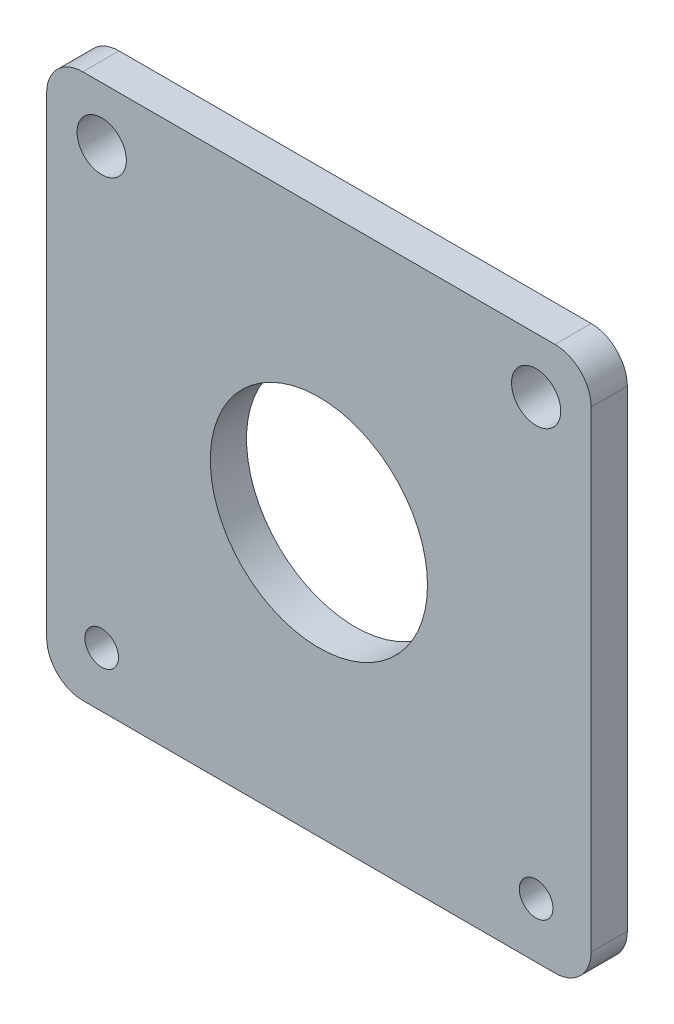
ISO-10303-21;
HEADER;
FILE_DESCRIPTION(('STEP AP214'),'2;1');
FILE_NAME('part.step','',(''),(''),'','','');
FILE_SCHEMA(('AUTOMOTIVE_DESIGN { 1 0 10303 214 1 1 1 1 }'));
ENDSEC;
DATA;
#1=APPLICATION_CONTEXT('core data for automotive mechanical design processes');
#2=APPLICATION_PROTOCOL_DEFINITION('international standard','automotive_design',2000,#1);
#3=PRODUCT_CONTEXT('',#1,'mechanical');
#4=PRODUCT('Part','Part','',(#3));
#5=PRODUCT_RELATED_PRODUCT_CATEGORY('part','',(#4));
#6=PRODUCT_DEFINITION_FORMATION('','',#4);
#7=PRODUCT_DEFINITION_CONTEXT('part definition',#1,'design');
#8=PRODUCT_DEFINITION('design','',#6,#7);
#9=PRODUCT_DEFINITION_SHAPE('','',#8);
#10=(LENGTH_UNIT() NAMED_UNIT(*) SI_UNIT(.MILLI.,.METRE.));
#11=(NAMED_UNIT(*) PLANE_ANGLE_UNIT() SI_UNIT($,.RADIAN.));
#12=(NAMED_UNIT(*) SI_UNIT($,.STERADIAN.) SOLID_ANGLE_UNIT());
#13=UNCERTAINTY_MEASURE_WITH_UNIT(LENGTH_MEASURE(1.E-05),#10,'distance_accuracy_value','');
#14=(GEOMETRIC_REPRESENTATION_CONTEXT(3) GLOBAL_UNCERTAINTY_ASSIGNED_CONTEXT((#13)) GLOBAL_UNIT_ASSIGNED_CONTEXT((#10,
#11,#12)) REPRESENTATION_CONTEXT('',''));
#15=CARTESIAN_POINT('',(0.,0.,0.));
#16=DIRECTION('',(0.,0.,1.));
#17=DIRECTION('',(1.,0.,0.));
#18=AXIS2_PLACEMENT_3D('',#15,#16,#17);
#19=CARTESIAN_POINT('',(23.876,-23.876,3.175));
#20=DIRECTION('',(0.,0.,1.));
#21=DIRECTION('',(1.,0.,0.));
#22=AXIS2_PLACEMENT_3D('',#19,#20,#21);
#23=PLANE('',#22);
#24=CARTESIAN_POINT('',(19.05,-19.05,3.175));
#25=DIRECTION('',(0.,0.,1.));
#26=DIRECTION('',(1.,0.,0.));
#27=AXIS2_PLACEMENT_3D('',#24,#25,#26);
#28=CIRCLE('',#27,1.4732);
#29=CARTESIAN_POINT('',(20.5232,-19.05,3.175));
#30=VERTEX_POINT('',#29);
#31=EDGE_CURVE('E333',#30,#30,#28,.T.);
#32=ORIENTED_EDGE('',*,*,#31,.F.);
#33=EDGE_LOOP('',(#32));
#34=FACE_BOUND('',#33,.T.);
#35=CARTESIAN_POINT('',(19.05,19.05,3.175));
#36=DIRECTION('',(0.,0.,1.));
#37=DIRECTION('',(1.,0.,0.));
#38=AXIS2_PLACEMENT_3D('',#35,#36,#37);
#39=CIRCLE('',#38,2.159);
#40=CARTESIAN_POINT('',(21.209,19.05,3.175));
#41=VERTEX_POINT('',#40);
#42=EDGE_CURVE('E319',#41,#41,#39,.T.);
#43=ORIENTED_EDGE('',*,*,#42,.F.);
#44=EDGE_LOOP('',(#43));
#45=FACE_BOUND('',#44,.T.);
#46=DIRECTION('',(0.,1.,0.));
#47=VECTOR('',#46,1.);
#48=CARTESIAN_POINT('',(23.876,23.876,3.175));
#49=LINE('',#48,#47);
#50=CARTESIAN_POINT('',(23.876,-20.701,3.175));
#51=VERTEX_POINT('',#50);
#52=CARTESIAN_POINT('',(23.876,20.701,3.175));
#53=VERTEX_POINT('',#52);
#54=EDGE_CURVE('E134',#51,#53,#49,.T.);
#55=ORIENTED_EDGE('',*,*,#54,.T.);
#56=CARTESIAN_POINT('',(20.701,20.701,3.175));
#57=DIRECTION('',(0.,0.,1.));
#58=DIRECTION('',(1.,0.,0.));
#59=AXIS2_PLACEMENT_3D('',#56,#57,#58);
#60=CIRCLE('',#59,3.175);
#61=CARTESIAN_POINT('',(20.701,23.876,3.175));
#62=VERTEX_POINT('',#61);
#63=EDGE_CURVE('E155',#53,#62,#60,.T.);
#64=ORIENTED_EDGE('',*,*,#63,.T.);
#65=DIRECTION('',(-1.,0.,0.));
#66=VECTOR('',#65,1.);
#67=CARTESIAN_POINT('',(-23.876,23.876,3.175));
#68=LINE('',#67,#66);
#69=CARTESIAN_POINT('',(-20.701,23.876,3.175));
#70=VERTEX_POINT('',#69);
#71=EDGE_CURVE('E116',#62,#70,#68,.T.);
#72=ORIENTED_EDGE('',*,*,#71,.T.);
#73=CARTESIAN_POINT('',(-20.701,20.701,3.175));
#74=DIRECTION('',(0.,0.,1.));
#75=DIRECTION('',(1.,0.,0.));
#76=AXIS2_PLACEMENT_3D('',#73,#74,#75);
#77=CIRCLE('',#76,3.175);
#78=CARTESIAN_POINT('',(-23.876,20.701,3.175));
#79=VERTEX_POINT('',#78);
#80=EDGE_CURVE('E150',#70,#79,#77,.T.);
#81=ORIENTED_EDGE('',*,*,#80,.T.);
#82=DIRECTION('',(0.,-1.,0.));
#83=VECTOR('',#82,1.);
#84=CARTESIAN_POINT('',(-23.876,23.876,3.175));
#85=LINE('',#84,#83);
#86=CARTESIAN_POINT('',(-23.876,-20.701,3.175));
#87=VERTEX_POINT('',#86);
#88=EDGE_CURVE('E138',#79,#87,#85,.T.);
#89=ORIENTED_EDGE('',*,*,#88,.T.);
#90=CARTESIAN_POINT('',(-20.701,-20.701,3.175));
#91=DIRECTION('',(0.,0.,1.));
#92=DIRECTION('',(1.,0.,0.));
#93=AXIS2_PLACEMENT_3D('',#90,#91,#92);
#94=CIRCLE('',#93,3.175);
#95=CARTESIAN_POINT('',(-20.701,-23.876,3.175));
#96=VERTEX_POINT('',#95);
#97=EDGE_CURVE('E52',#87,#96,#94,.T.);
#98=ORIENTED_EDGE('',*,*,#97,.T.);
#99=DIRECTION('',(1.,0.,0.));
#100=VECTOR('',#99,1.);
#101=CARTESIAN_POINT('',(-23.876,-23.876,3.175));
#102=LINE('',#101,#100);
#103=CARTESIAN_POINT('',(20.701,-23.876,3.175));
#104=VERTEX_POINT('',#103);
#105=EDGE_CURVE('E140',#96,#104,#102,.T.);
#106=ORIENTED_EDGE('',*,*,#105,.T.);
#107=CARTESIAN_POINT('',(20.701,-20.701,3.175));
#108=DIRECTION('',(0.,0.,1.));
#109=DIRECTION('',(1.,0.,0.));
#110=AXIS2_PLACEMENT_3D('',#107,#108,#109);
#111=CIRCLE('',#110,3.175);
#112=EDGE_CURVE('E153',#104,#51,#111,.T.);
#113=ORIENTED_EDGE('',*,*,#112,.T.);
#114=EDGE_LOOP('',(#55,#64,#72,#81,#89,#98,#106,#113));
#115=FACE_BOUND('',#114,.T.);
#116=CARTESIAN_POINT('',(0.,0.,3.175));
#117=DIRECTION('',(0.,0.,1.));
#118=DIRECTION('',(1.,0.,0.));
#119=AXIS2_PLACEMENT_3D('',#116,#117,#118);
#120=CIRCLE('',#119,9.525);
#121=CARTESIAN_POINT('',(9.525,0.,3.175));
#122=VERTEX_POINT('',#121);
#123=EDGE_CURVE('E129',#122,#122,#120,.T.);
#124=ORIENTED_EDGE('',*,*,#123,.F.);
#125=EDGE_LOOP('',(#124));
#126=FACE_BOUND('',#125,.T.);
#127=CARTESIAN_POINT('',(-19.05,19.05,3.175));
#128=DIRECTION('',(0.,0.,1.));
#129=DIRECTION('',(-1.,0.,0.));
#130=AXIS2_PLACEMENT_3D('',#127,#128,#129);
#131=CIRCLE('',#130,2.159);
#132=CARTESIAN_POINT('',(-21.209,19.05,3.175));
#133=VERTEX_POINT('',#132);
#134=EDGE_CURVE('E327',#133,#133,#131,.T.);
#135=ORIENTED_EDGE('',*,*,#134,.F.);
#136=EDGE_LOOP('',(#135));
#137=FACE_BOUND('',#136,.T.);
#138=CARTESIAN_POINT('',(-19.05,-19.05,3.175));
#139=DIRECTION('',(0.,0.,1.));
#140=DIRECTION('',(-1.,0.,0.));
#141=AXIS2_PLACEMENT_3D('',#138,#139,#140);
#142=CIRCLE('',#141,1.4732);
#143=CARTESIAN_POINT('',(-20.5232,-19.05,3.175));
#144=VERTEX_POINT('',#143);
#145=EDGE_CURVE('E339',#144,#144,#142,.T.);
#146=ORIENTED_EDGE('',*,*,#145,.F.);
#147=EDGE_LOOP('',(#146));
#148=FACE_BOUND('',#147,.T.);
#149=ADVANCED_FACE('F30',(#34,#45,#115,#126,#137,#148),#23,.T.);
#150=CARTESIAN_POINT('',(23.876,-23.876,0.));
#151=DIRECTION('',(0.,0.,1.));
#152=DIRECTION('',(1.,0.,0.));
#153=AXIS2_PLACEMENT_3D('',#150,#151,#152);
#154=PLANE('',#153);
#155=CARTESIAN_POINT('',(19.05,-19.05,0.));
#156=DIRECTION('',(0.,0.,1.));
#157=DIRECTION('',(1.,0.,0.));
#158=AXIS2_PLACEMENT_3D('',#155,#156,#157);
#159=CIRCLE('',#158,1.4732);
#160=CARTESIAN_POINT('',(20.5232,-19.05,0.));
#161=VERTEX_POINT('',#160);
#162=EDGE_CURVE('E336',#161,#161,#159,.T.);
#163=ORIENTED_EDGE('',*,*,#162,.T.);
#164=EDGE_LOOP('',(#163));
#165=FACE_BOUND('',#164,.T.);
#166=CARTESIAN_POINT('',(19.05,19.05,0.));
#167=DIRECTION('',(0.,0.,1.));
#168=DIRECTION('',(1.,0.,0.));
#169=AXIS2_PLACEMENT_3D('',#166,#167,#168);
#170=CIRCLE('',#169,2.159);
#171=CARTESIAN_POINT('',(21.209,19.05,0.));
#172=VERTEX_POINT('',#171);
#173=EDGE_CURVE('E322',#172,#172,#170,.T.);
#174=ORIENTED_EDGE('',*,*,#173,.T.);
#175=EDGE_LOOP('',(#174));
#176=FACE_BOUND('',#175,.T.);
#177=DIRECTION('',(-1.,0.,0.));
#178=VECTOR('',#177,1.);
#179=CARTESIAN_POINT('',(-23.876,23.876,0.));
#180=LINE('',#179,#178);
#181=CARTESIAN_POINT('',(20.701,23.876,0.));
#182=VERTEX_POINT('',#181);
#183=CARTESIAN_POINT('',(-20.701,23.876,0.));
#184=VERTEX_POINT('',#183);
#185=EDGE_CURVE('E113',#182,#184,#180,.T.);
#186=ORIENTED_EDGE('',*,*,#185,.F.);
#187=CARTESIAN_POINT('',(20.701,20.701,0.));
#188=DIRECTION('',(0.,0.,1.));
#189=DIRECTION('',(1.,0.,0.));
#190=AXIS2_PLACEMENT_3D('',#187,#188,#189);
#191=CIRCLE('',#190,3.175);
#192=CARTESIAN_POINT('',(23.876,20.701,0.));
#193=VERTEX_POINT('',#192);
#194=EDGE_CURVE('E96',#182,#193,#191,.F.);
#195=ORIENTED_EDGE('',*,*,#194,.T.);
#196=DIRECTION('',(0.,1.,0.));
#197=VECTOR('',#196,1.);
#198=CARTESIAN_POINT('',(23.876,23.876,0.));
#199=LINE('',#198,#197);
#200=CARTESIAN_POINT('',(23.876,-20.701,0.));
#201=VERTEX_POINT('',#200);
#202=EDGE_CURVE('E124',#201,#193,#199,.T.);
#203=ORIENTED_EDGE('',*,*,#202,.F.);
#204=CARTESIAN_POINT('',(20.701,-20.701,0.));
#205=DIRECTION('',(0.,0.,1.));
#206=DIRECTION('',(1.,0.,0.));
#207=AXIS2_PLACEMENT_3D('',#204,#205,#206);
#208=CIRCLE('',#207,3.175);
#209=CARTESIAN_POINT('',(20.701,-23.876,0.));
#210=VERTEX_POINT('',#209);
#211=EDGE_CURVE('E107',#201,#210,#208,.F.);
#212=ORIENTED_EDGE('',*,*,#211,.T.);
#213=DIRECTION('',(1.,0.,0.));
#214=VECTOR('',#213,1.);
#215=CARTESIAN_POINT('',(-23.876,-23.876,0.));
#216=LINE('',#215,#214);
#217=CARTESIAN_POINT('',(-20.701,-23.876,0.));
#218=VERTEX_POINT('',#217);
#219=EDGE_CURVE('E127',#218,#210,#216,.T.);
#220=ORIENTED_EDGE('',*,*,#219,.F.);
#221=CARTESIAN_POINT('',(-20.701,-20.701,0.));
#222=DIRECTION('',(0.,0.,1.));
#223=DIRECTION('',(1.,0.,0.));
#224=AXIS2_PLACEMENT_3D('',#221,#222,#223);
#225=CIRCLE('',#224,3.175);
#226=CARTESIAN_POINT('',(-23.876,-20.701,0.));
#227=VERTEX_POINT('',#226);
#228=EDGE_CURVE('E144',#218,#227,#225,.F.);
#229=ORIENTED_EDGE('',*,*,#228,.T.);
#230=DIRECTION('',(0.,-1.,0.));
#231=VECTOR('',#230,1.);
#232=CARTESIAN_POINT('',(-23.876,23.876,0.));
#233=LINE('',#232,#231);
#234=CARTESIAN_POINT('',(-23.876,20.701,0.));
#235=VERTEX_POINT('',#234);
#236=EDGE_CURVE('E123',#235,#227,#233,.T.);
#237=ORIENTED_EDGE('',*,*,#236,.F.);
#238=CARTESIAN_POINT('',(-20.701,20.701,0.));
#239=DIRECTION('',(0.,0.,1.));
#240=DIRECTION('',(1.,0.,0.));
#241=AXIS2_PLACEMENT_3D('',#238,#239,#240);
#242=CIRCLE('',#241,3.175);
#243=EDGE_CURVE('E117',#235,#184,#242,.F.);
#244=ORIENTED_EDGE('',*,*,#243,.T.);
#245=EDGE_LOOP('',(#186,#195,#203,#212,#220,#229,#237,#244));
#246=FACE_BOUND('',#245,.T.);
#247=CARTESIAN_POINT('',(0.,0.,0.));
#248=DIRECTION('',(0.,0.,1.));
#249=DIRECTION('',(1.,0.,0.));
#250=AXIS2_PLACEMENT_3D('',#247,#248,#249);
#251=CIRCLE('',#250,9.525);
#252=CARTESIAN_POINT('',(9.525,0.,0.));
#253=VERTEX_POINT('',#252);
#254=EDGE_CURVE('E318',#253,#253,#251,.T.);
#255=ORIENTED_EDGE('',*,*,#254,.T.);
#256=EDGE_LOOP('',(#255));
#257=FACE_BOUND('',#256,.T.);
#258=CARTESIAN_POINT('',(-19.05,19.05,0.));
#259=DIRECTION('',(0.,0.,1.));
#260=DIRECTION('',(-1.,0.,0.));
#261=AXIS2_PLACEMENT_3D('',#258,#259,#260);
#262=CIRCLE('',#261,2.159);
#263=CARTESIAN_POINT('',(-21.209,19.05,0.));
#264=VERTEX_POINT('',#263);
#265=EDGE_CURVE('E330',#264,#264,#262,.T.);
#266=ORIENTED_EDGE('',*,*,#265,.T.);
#267=EDGE_LOOP('',(#266));
#268=FACE_BOUND('',#267,.T.);
#269=CARTESIAN_POINT('',(-19.05,-19.05,0.));
#270=DIRECTION('',(0.,0.,1.));
#271=DIRECTION('',(-1.,0.,0.));
#272=AXIS2_PLACEMENT_3D('',#269,#270,#271);
#273=CIRCLE('',#272,1.4732);
#274=CARTESIAN_POINT('',(-20.5232,-19.05,0.));
#275=VERTEX_POINT('',#274);
#276=EDGE_CURVE('E342',#275,#275,#273,.T.);
#277=ORIENTED_EDGE('',*,*,#276,.T.);
#278=EDGE_LOOP('',(#277));
#279=FACE_BOUND('',#278,.T.);
#280=ADVANCED_FACE('F120',(#165,#176,#246,#257,#268,#279),#154,.F.);
#281=CARTESIAN_POINT('',(23.876,23.876,3.175));
#282=DIRECTION('',(-1.,0.,0.));
#283=DIRECTION('',(0.,0.,1.));
#284=AXIS2_PLACEMENT_3D('',#281,#282,#283);
#285=PLANE('',#284);
#286=ORIENTED_EDGE('',*,*,#202,.T.);
#287=DIRECTION('',(0.,0.,-1.));
#288=VECTOR('',#287,1.);
#289=CARTESIAN_POINT('',(23.876,20.701,3.175));
#290=LINE('',#289,#288);
#291=EDGE_CURVE('E101',#193,#53,#290,.F.);
#292=ORIENTED_EDGE('',*,*,#291,.T.);
#293=ORIENTED_EDGE('',*,*,#54,.F.);
#294=DIRECTION('',(0.,0.,-1.));
#295=VECTOR('',#294,1.);
#296=CARTESIAN_POINT('',(23.876,-20.701,3.175));
#297=LINE('',#296,#295);
#298=EDGE_CURVE('E106',#51,#201,#297,.T.);
#299=ORIENTED_EDGE('',*,*,#298,.T.);
#300=EDGE_LOOP('',(#286,#292,#293,#299));
#301=FACE_BOUND('',#300,.T.);
#302=ADVANCED_FACE('F32',(#301),#285,.F.);
#303=CARTESIAN_POINT('',(-23.876,23.876,3.175));
#304=DIRECTION('',(0.,-1.,0.));
#305=DIRECTION('',(0.,0.,-1.));
#306=AXIS2_PLACEMENT_3D('',#303,#304,#305);
#307=PLANE('',#306);
#308=ORIENTED_EDGE('',*,*,#71,.F.);
#309=DIRECTION('',(0.,0.,-1.));
#310=VECTOR('',#309,1.);
#311=CARTESIAN_POINT('',(20.701,23.876,3.175));
#312=LINE('',#311,#310);
#313=EDGE_CURVE('E100',#62,#182,#312,.T.);
#314=ORIENTED_EDGE('',*,*,#313,.T.);
#315=ORIENTED_EDGE('',*,*,#185,.T.);
#316=DIRECTION('',(0.,0.,-1.));
#317=VECTOR('',#316,1.);
#318=CARTESIAN_POINT('',(-20.701,23.876,3.175));
#319=LINE('',#318,#317);
#320=EDGE_CURVE('E118',#184,#70,#319,.F.);
#321=ORIENTED_EDGE('',*,*,#320,.T.);
#322=EDGE_LOOP('',(#308,#314,#315,#321));
#323=FACE_BOUND('',#322,.T.);
#324=ADVANCED_FACE('F112',(#323),#307,.F.);
#325=CARTESIAN_POINT('',(-23.876,23.876,3.175));
#326=DIRECTION('',(1.,0.,0.));
#327=DIRECTION('',(0.,0.,-1.));
#328=AXIS2_PLACEMENT_3D('',#325,#326,#327);
#329=PLANE('',#328);
#330=ORIENTED_EDGE('',*,*,#236,.T.);
#331=DIRECTION('',(0.,0.,-1.));
#332=VECTOR('',#331,1.);
#333=CARTESIAN_POINT('',(-23.876,-20.701,3.175));
#334=LINE('',#333,#332);
#335=EDGE_CURVE('E11',#227,#87,#334,.F.);
#336=ORIENTED_EDGE('',*,*,#335,.T.);
#337=ORIENTED_EDGE('',*,*,#88,.F.);
#338=DIRECTION('',(0.,0.,-1.));
#339=VECTOR('',#338,1.);
#340=CARTESIAN_POINT('',(-23.876,20.701,3.175));
#341=LINE('',#340,#339);
#342=EDGE_CURVE('E38',#79,#235,#341,.T.);
#343=ORIENTED_EDGE('',*,*,#342,.T.);
#344=EDGE_LOOP('',(#330,#336,#337,#343));
#345=FACE_BOUND('',#344,.T.);
#346=ADVANCED_FACE('F164',(#345),#329,.F.);
#347=CARTESIAN_POINT('',(-23.876,-23.876,3.175));
#348=DIRECTION('',(0.,1.,0.));
#349=DIRECTION('',(0.,0.,1.));
#350=AXIS2_PLACEMENT_3D('',#347,#348,#349);
#351=PLANE('',#350);
#352=ORIENTED_EDGE('',*,*,#219,.T.);
#353=DIRECTION('',(0.,0.,-1.));
#354=VECTOR('',#353,1.);
#355=CARTESIAN_POINT('',(20.701,-23.876,3.175));
#356=LINE('',#355,#354);
#357=EDGE_CURVE('E45',#210,#104,#356,.F.);
#358=ORIENTED_EDGE('',*,*,#357,.T.);
#359=ORIENTED_EDGE('',*,*,#105,.F.);
#360=DIRECTION('',(0.,0.,-1.));
#361=VECTOR('',#360,1.);
#362=CARTESIAN_POINT('',(-20.701,-23.876,3.175));
#363=LINE('',#362,#361);
#364=EDGE_CURVE('E157',#96,#218,#363,.T.);
#365=ORIENTED_EDGE('',*,*,#364,.T.);
#366=EDGE_LOOP('',(#352,#358,#359,#365));
#367=FACE_BOUND('',#366,.T.);
#368=ADVANCED_FACE('F172',(#367),#351,.F.);
#369=CARTESIAN_POINT('',(0.,0.,3.175));
#370=DIRECTION('',(0.,0.,-1.));
#371=DIRECTION('',(-1.,0.,0.));
#372=AXIS2_PLACEMENT_3D('',#369,#370,#371);
#373=CYLINDRICAL_SURFACE('',#372,9.525);
#374=ORIENTED_EDGE('',*,*,#123,.T.);
#375=EDGE_LOOP('',(#374));
#376=FACE_BOUND('',#375,.T.);
#377=ORIENTED_EDGE('',*,*,#254,.F.);
#378=EDGE_LOOP('',(#377));
#379=FACE_BOUND('',#378,.T.);
#380=ADVANCED_FACE('F201',(#376,#379),#373,.F.);
#381=CARTESIAN_POINT('',(19.05,19.05,3.175));
#382=DIRECTION('',(0.,0.,-1.));
#383=DIRECTION('',(-1.,0.,0.));
#384=AXIS2_PLACEMENT_3D('',#381,#382,#383);
#385=CYLINDRICAL_SURFACE('',#384,2.159);
#386=ORIENTED_EDGE('',*,*,#42,.T.);
#387=EDGE_LOOP('',(#386));
#388=FACE_BOUND('',#387,.T.);
#389=ORIENTED_EDGE('',*,*,#173,.F.);
#390=EDGE_LOOP('',(#389));
#391=FACE_BOUND('',#390,.T.);
#392=ADVANCED_FACE('F249',(#388,#391),#385,.F.);
#393=CARTESIAN_POINT('',(-19.05,19.05,3.175));
#394=DIRECTION('',(0.,0.,-1.));
#395=DIRECTION('',(-1.,0.,0.));
#396=AXIS2_PLACEMENT_3D('',#393,#394,#395);
#397=CYLINDRICAL_SURFACE('',#396,2.159);
#398=ORIENTED_EDGE('',*,*,#134,.T.);
#399=EDGE_LOOP('',(#398));
#400=FACE_BOUND('',#399,.T.);
#401=ORIENTED_EDGE('',*,*,#265,.F.);
#402=EDGE_LOOP('',(#401));
#403=FACE_BOUND('',#402,.T.);
#404=ADVANCED_FACE('F239',(#400,#403),#397,.F.);
#405=CARTESIAN_POINT('',(19.05,-19.05,3.175));
#406=DIRECTION('',(0.,0.,-1.));
#407=DIRECTION('',(-1.,0.,0.));
#408=AXIS2_PLACEMENT_3D('',#405,#406,#407);
#409=CYLINDRICAL_SURFACE('',#408,1.4732);
#410=ORIENTED_EDGE('',*,*,#31,.T.);
#411=EDGE_LOOP('',(#410));
#412=FACE_BOUND('',#411,.T.);
#413=ORIENTED_EDGE('',*,*,#162,.F.);
#414=EDGE_LOOP('',(#413));
#415=FACE_BOUND('',#414,.T.);
#416=ADVANCED_FACE('F227',(#412,#415),#409,.F.);
#417=CARTESIAN_POINT('',(-19.05,-19.05,3.175));
#418=DIRECTION('',(0.,0.,-1.));
#419=DIRECTION('',(-1.,0.,0.));
#420=AXIS2_PLACEMENT_3D('',#417,#418,#419);
#421=CYLINDRICAL_SURFACE('',#420,1.4732);
#422=ORIENTED_EDGE('',*,*,#145,.T.);
#423=EDGE_LOOP('',(#422));
#424=FACE_BOUND('',#423,.T.);
#425=ORIENTED_EDGE('',*,*,#276,.F.);
#426=EDGE_LOOP('',(#425));
#427=FACE_BOUND('',#426,.T.);
#428=ADVANCED_FACE('F222',(#424,#427),#421,.F.);
#429=CARTESIAN_POINT('',(20.701,20.701,3.175));
#430=DIRECTION('',(0.,0.,-1.));
#431=DIRECTION('',(-1.,0.,0.));
#432=AXIS2_PLACEMENT_3D('',#429,#430,#431);
#433=CYLINDRICAL_SURFACE('',#432,3.175);
#434=ORIENTED_EDGE('',*,*,#63,.F.);
#435=ORIENTED_EDGE('',*,*,#291,.F.);
#436=ORIENTED_EDGE('',*,*,#194,.F.);
#437=ORIENTED_EDGE('',*,*,#313,.F.);
#438=EDGE_LOOP('',(#434,#435,#436,#437));
#439=FACE_BOUND('',#438,.T.);
#440=ADVANCED_FACE('F99',(#439),#433,.T.);
#441=CARTESIAN_POINT('',(20.701,-20.701,3.175));
#442=DIRECTION('',(0.,0.,-1.));
#443=DIRECTION('',(-1.,0.,0.));
#444=AXIS2_PLACEMENT_3D('',#441,#442,#443);
#445=CYLINDRICAL_SURFACE('',#444,3.175);
#446=ORIENTED_EDGE('',*,*,#112,.F.);
#447=ORIENTED_EDGE('',*,*,#357,.F.);
#448=ORIENTED_EDGE('',*,*,#211,.F.);
#449=ORIENTED_EDGE('',*,*,#298,.F.);
#450=EDGE_LOOP('',(#446,#447,#448,#449));
#451=FACE_BOUND('',#450,.T.);
#452=ADVANCED_FACE('F178',(#451),#445,.T.);
#453=CARTESIAN_POINT('',(-20.701,-20.701,3.175));
#454=DIRECTION('',(0.,0.,-1.));
#455=DIRECTION('',(-1.,0.,0.));
#456=AXIS2_PLACEMENT_3D('',#453,#454,#455);
#457=CYLINDRICAL_SURFACE('',#456,3.175);
#458=ORIENTED_EDGE('',*,*,#97,.F.);
#459=ORIENTED_EDGE('',*,*,#335,.F.);
#460=ORIENTED_EDGE('',*,*,#228,.F.);
#461=ORIENTED_EDGE('',*,*,#364,.F.);
#462=EDGE_LOOP('',(#458,#459,#460,#461));
#463=FACE_BOUND('',#462,.T.);
#464=ADVANCED_FACE('F171',(#463),#457,.T.);
#465=CARTESIAN_POINT('',(-20.701,20.701,3.175));
#466=DIRECTION('',(0.,0.,-1.));
#467=DIRECTION('',(-1.,0.,0.));
#468=AXIS2_PLACEMENT_3D('',#465,#466,#467);
#469=CYLINDRICAL_SURFACE('',#468,3.175);
#470=ORIENTED_EDGE('',*,*,#80,.F.);
#471=ORIENTED_EDGE('',*,*,#320,.F.);
#472=ORIENTED_EDGE('',*,*,#243,.F.);
#473=ORIENTED_EDGE('',*,*,#342,.F.);
#474=EDGE_LOOP('',(#470,#471,#472,#473));
#475=FACE_BOUND('',#474,.T.);
#476=ADVANCED_FACE('F180',(#475),#469,.T.);
#477=CLOSED_SHELL('',(#149,#280,#302,#324,#346,#368,#380,#392,#404,#416,#428,#440,#452,#464,#476));
#478=MANIFOLD_SOLID_BREP('B2',#477);
#479=ADVANCED_BREP_SHAPE_REPRESENTATION('',(#18,#478),#14);
#480=SHAPE_DEFINITION_REPRESENTATION(#9,#479);
ENDSEC;
END-ISO-10303-21;
